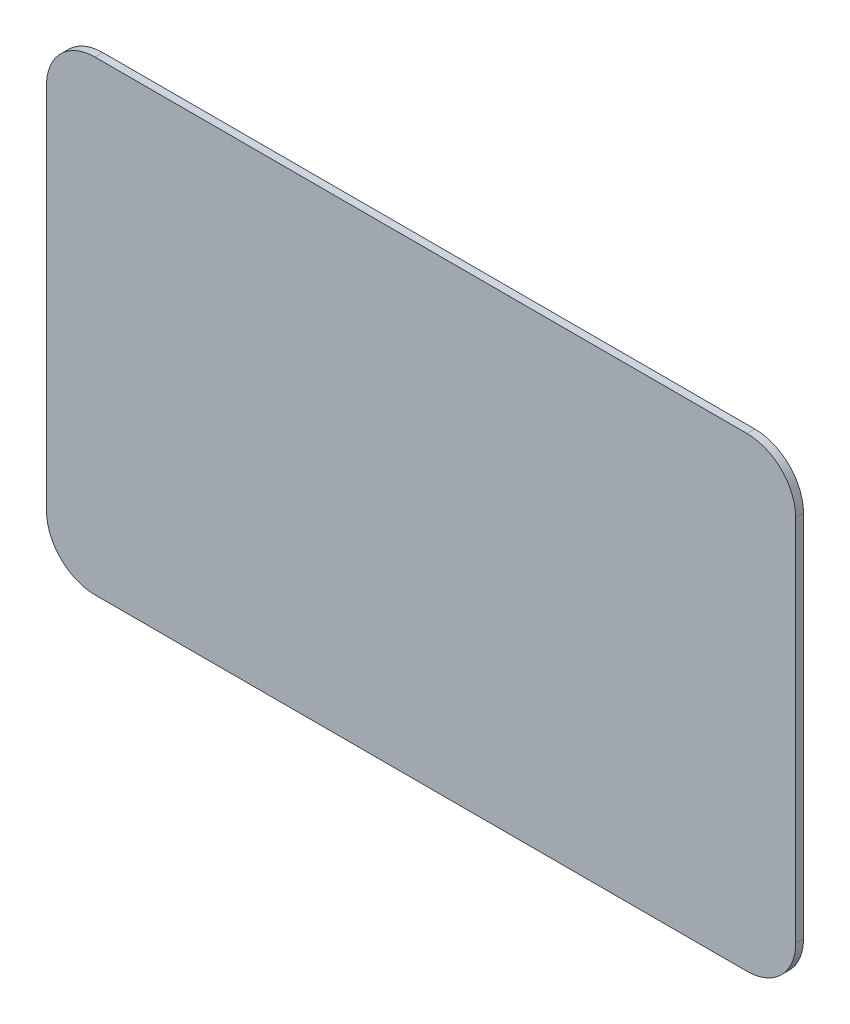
ISO-10303-21;
HEADER;
FILE_DESCRIPTION(('STEP AP214'),'2;1');
FILE_NAME('part.step','',(''),(''),'','','');
FILE_SCHEMA(('AUTOMOTIVE_DESIGN { 1 0 10303 214 1 1 1 1 }'));
ENDSEC;
DATA;
#1=APPLICATION_CONTEXT('core data for automotive mechanical design processes');
#2=APPLICATION_PROTOCOL_DEFINITION('international standard','automotive_design',2000,#1);
#3=PRODUCT_CONTEXT('',#1,'mechanical');
#4=PRODUCT('Part','Part','',(#3));
#5=PRODUCT_RELATED_PRODUCT_CATEGORY('part','',(#4));
#6=PRODUCT_DEFINITION_FORMATION('','',#4);
#7=PRODUCT_DEFINITION_CONTEXT('part definition',#1,'design');
#8=PRODUCT_DEFINITION('design','',#6,#7);
#9=PRODUCT_DEFINITION_SHAPE('','',#8);
#10=(LENGTH_UNIT() NAMED_UNIT(*) SI_UNIT(.MILLI.,.METRE.));
#11=(NAMED_UNIT(*) PLANE_ANGLE_UNIT() SI_UNIT($,.RADIAN.));
#12=(NAMED_UNIT(*) SI_UNIT($,.STERADIAN.) SOLID_ANGLE_UNIT());
#13=UNCERTAINTY_MEASURE_WITH_UNIT(LENGTH_MEASURE(1.E-05),#10,'distance_accuracy_value','');
#14=(GEOMETRIC_REPRESENTATION_CONTEXT(3) GLOBAL_UNCERTAINTY_ASSIGNED_CONTEXT((#13)) GLOBAL_UNIT_ASSIGNED_CONTEXT((#10,
#11,#12)) REPRESENTATION_CONTEXT('',''));
#15=CARTESIAN_POINT('',(0.,0.,0.));
#16=DIRECTION('',(0.,0.,1.));
#17=DIRECTION('',(1.,0.,0.));
#18=AXIS2_PLACEMENT_3D('',#15,#16,#17);
#19=CARTESIAN_POINT('',(32.4999999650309,13.,8.23));
#20=DIRECTION('',(0.,0.,-1.));
#21=DIRECTION('',(-1.,0.,0.));
#22=AXIS2_PLACEMENT_3D('',#19,#20,#21);
#23=CYLINDRICAL_SURFACE('',#22,8.5);
#24=DIRECTION('',(0.,0.,-1.));
#25=VECTOR('',#24,1.);
#26=CARTESIAN_POINT('',(40.9999999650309,13.,8.23));
#27=LINE('',#26,#25);
#28=CARTESIAN_POINT('',(40.9999999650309,13.,8.23));
#29=VERTEX_POINT('',#28);
#30=CARTESIAN_POINT('',(40.9999999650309,13.,8.2));
#31=VERTEX_POINT('',#30);
#32=EDGE_CURVE('E253',#29,#31,#27,.T.);
#33=ORIENTED_EDGE('',*,*,#32,.F.);
#34=CARTESIAN_POINT('',(32.4999999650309,13.,8.23));
#35=DIRECTION('',(0.,0.,-1.));
#36=DIRECTION('',(-1.,0.,0.));
#37=AXIS2_PLACEMENT_3D('',#34,#35,#36);
#38=CIRCLE('',#37,8.5);
#39=CARTESIAN_POINT('',(23.9999999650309,13.,8.23));
#40=VERTEX_POINT('',#39);
#41=EDGE_CURVE('E11',#40,#29,#38,.T.);
#42=ORIENTED_EDGE('',*,*,#41,.F.);
#43=DIRECTION('',(0.,0.,-1.));
#44=VECTOR('',#43,1.);
#45=CARTESIAN_POINT('',(23.9999999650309,13.,8.23));
#46=LINE('',#45,#44);
#47=CARTESIAN_POINT('',(23.9999999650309,13.,8.2));
#48=VERTEX_POINT('',#47);
#49=EDGE_CURVE('E166',#40,#48,#46,.T.);
#50=ORIENTED_EDGE('',*,*,#49,.T.);
#51=CARTESIAN_POINT('',(32.4999999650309,13.,8.2));
#52=DIRECTION('',(0.,0.,-1.));
#53=DIRECTION('',(-1.,0.,0.));
#54=AXIS2_PLACEMENT_3D('',#51,#52,#53);
#55=CIRCLE('',#54,8.5);
#56=EDGE_CURVE('E150',#48,#31,#55,.T.);
#57=ORIENTED_EDGE('',*,*,#56,.T.);
#58=EDGE_LOOP('',(#33,#42,#50,#57));
#59=FACE_BOUND('',#58,.T.);
#60=ADVANCED_FACE('F18',(#59),#23,.F.);
#61=CARTESIAN_POINT('',(32.4999999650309,13.,8.23));
#62=DIRECTION('',(0.,0.,-1.));
#63=DIRECTION('',(0.,-1.,0.));
#64=AXIS2_PLACEMENT_3D('',#61,#62,#63);
#65=PLANE('',#64);
#66=ORIENTED_EDGE('',*,*,#41,.T.);
#67=CARTESIAN_POINT('',(32.4999999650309,13.,8.23));
#68=DIRECTION('',(0.,0.,-1.));
#69=DIRECTION('',(-1.,0.,0.));
#70=AXIS2_PLACEMENT_3D('',#67,#68,#69);
#71=CIRCLE('',#70,8.5);
#72=EDGE_CURVE('E264',#29,#40,#71,.T.);
#73=ORIENTED_EDGE('',*,*,#72,.T.);
#74=EDGE_LOOP('',(#66,#73));
#75=FACE_BOUND('',#74,.T.);
#76=ADVANCED_FACE('F293',(#75),#65,.T.);
#77=CARTESIAN_POINT('',(12.4999999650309,13.0000000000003,8.23));
#78=DIRECTION('',(0.,0.,-1.));
#79=DIRECTION('',(-1.,0.,0.));
#80=AXIS2_PLACEMENT_3D('',#77,#78,#79);
#81=CYLINDRICAL_SURFACE('',#80,8.5);
#82=DIRECTION('',(0.,0.,-1.));
#83=VECTOR('',#82,1.);
#84=CARTESIAN_POINT('',(20.9999999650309,13.0000000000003,8.23));
#85=LINE('',#84,#83);
#86=CARTESIAN_POINT('',(20.9999999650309,13.0000000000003,8.23));
#87=VERTEX_POINT('',#86);
#88=CARTESIAN_POINT('',(20.9999999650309,13.0000000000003,8.2));
#89=VERTEX_POINT('',#88);
#90=EDGE_CURVE('E143',#87,#89,#85,.T.);
#91=ORIENTED_EDGE('',*,*,#90,.F.);
#92=CARTESIAN_POINT('',(12.4999999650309,13.0000000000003,8.23));
#93=DIRECTION('',(0.,0.,-1.));
#94=DIRECTION('',(-1.,0.,0.));
#95=AXIS2_PLACEMENT_3D('',#92,#93,#94);
#96=CIRCLE('',#95,8.5);
#97=CARTESIAN_POINT('',(3.99999996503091,13.0000000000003,8.23));
#98=VERTEX_POINT('',#97);
#99=EDGE_CURVE('E26',#98,#87,#96,.T.);
#100=ORIENTED_EDGE('',*,*,#99,.F.);
#101=DIRECTION('',(0.,0.,-1.));
#102=VECTOR('',#101,1.);
#103=CARTESIAN_POINT('',(3.99999996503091,13.0000000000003,8.23));
#104=LINE('',#103,#102);
#105=CARTESIAN_POINT('',(3.99999996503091,13.0000000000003,8.2));
#106=VERTEX_POINT('',#105);
#107=EDGE_CURVE('E146',#98,#106,#104,.T.);
#108=ORIENTED_EDGE('',*,*,#107,.T.);
#109=CARTESIAN_POINT('',(12.4999999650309,13.0000000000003,8.2));
#110=DIRECTION('',(0.,0.,-1.));
#111=DIRECTION('',(-1.,0.,0.));
#112=AXIS2_PLACEMENT_3D('',#109,#110,#111);
#113=CIRCLE('',#112,8.5);
#114=EDGE_CURVE('E139',#106,#89,#113,.T.);
#115=ORIENTED_EDGE('',*,*,#114,.T.);
#116=EDGE_LOOP('',(#91,#100,#108,#115));
#117=FACE_BOUND('',#116,.T.);
#118=ADVANCED_FACE('F141',(#117),#81,.F.);
#119=CARTESIAN_POINT('',(12.4999999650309,13.0000000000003,8.23));
#120=DIRECTION('',(0.,0.,-1.));
#121=DIRECTION('',(0.,-1.,0.));
#122=AXIS2_PLACEMENT_3D('',#119,#120,#121);
#123=PLANE('',#122);
#124=ORIENTED_EDGE('',*,*,#99,.T.);
#125=CARTESIAN_POINT('',(12.4999999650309,13.0000000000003,8.23));
#126=DIRECTION('',(0.,0.,-1.));
#127=DIRECTION('',(-1.,0.,0.));
#128=AXIS2_PLACEMENT_3D('',#125,#126,#127);
#129=CIRCLE('',#128,8.5);
#130=EDGE_CURVE('E159',#87,#98,#129,.T.);
#131=ORIENTED_EDGE('',*,*,#130,.T.);
#132=EDGE_LOOP('',(#124,#131));
#133=FACE_BOUND('',#132,.T.);
#134=ADVANCED_FACE('F281',(#133),#123,.T.);
#135=CARTESIAN_POINT('',(-0.500000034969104,2.4,8.2));
#136=DIRECTION('',(0.,0.,1.));
#137=DIRECTION('',(1.,0.,0.));
#138=AXIS2_PLACEMENT_3D('',#135,#136,#137);
#139=PLANE('',#138);
#140=ORIENTED_EDGE('',*,*,#114,.F.);
#141=CARTESIAN_POINT('',(12.4999999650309,13.0000000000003,8.2));
#142=DIRECTION('',(0.,0.,-1.));
#143=DIRECTION('',(-1.,0.,0.));
#144=AXIS2_PLACEMENT_3D('',#141,#142,#143);
#145=CIRCLE('',#144,8.5);
#146=EDGE_CURVE('E151',#89,#106,#145,.T.);
#147=ORIENTED_EDGE('',*,*,#146,.F.);
#148=EDGE_LOOP('',(#140,#147));
#149=FACE_BOUND('',#148,.T.);
#150=ORIENTED_EDGE('',*,*,#56,.F.);
#151=CARTESIAN_POINT('',(32.4999999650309,13.,8.2));
#152=DIRECTION('',(0.,0.,-1.));
#153=DIRECTION('',(-1.,0.,0.));
#154=AXIS2_PLACEMENT_3D('',#151,#152,#153);
#155=CIRCLE('',#154,8.5);
#156=EDGE_CURVE('E257',#31,#48,#155,.T.);
#157=ORIENTED_EDGE('',*,*,#156,.F.);
#158=EDGE_LOOP('',(#150,#157));
#159=FACE_BOUND('',#158,.T.);
#160=CARTESIAN_POINT('',(-0.500000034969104,28.4,8.2));
#161=DIRECTION('',(0.,0.,1.));
#162=DIRECTION('',(1.,0.,0.));
#163=AXIS2_PLACEMENT_3D('',#160,#161,#162);
#164=CIRCLE('',#163,3.43);
#165=CARTESIAN_POINT('',(-0.500000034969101,31.83,8.2));
#166=VERTEX_POINT('',#165);
#167=CARTESIAN_POINT('',(-3.9300000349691,28.4,8.2));
#168=VERTEX_POINT('',#167);
#169=EDGE_CURVE('E200',#166,#168,#164,.T.);
#170=ORIENTED_EDGE('',*,*,#169,.F.);
#171=DIRECTION('',(-1.,0.,0.));
#172=VECTOR('',#171,1.);
#173=CARTESIAN_POINT('',(45.4999999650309,31.83,8.2));
#174=LINE('',#173,#172);
#175=CARTESIAN_POINT('',(45.4999999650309,31.83,8.2));
#176=VERTEX_POINT('',#175);
#177=EDGE_CURVE('E211',#176,#166,#174,.T.);
#178=ORIENTED_EDGE('',*,*,#177,.F.);
#179=CARTESIAN_POINT('',(45.4999999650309,28.4,8.2));
#180=DIRECTION('',(0.,0.,1.));
#181=DIRECTION('',(1.,0.,0.));
#182=AXIS2_PLACEMENT_3D('',#179,#180,#181);
#183=CIRCLE('',#182,3.43);
#184=CARTESIAN_POINT('',(48.9299999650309,28.4,8.2));
#185=VERTEX_POINT('',#184);
#186=EDGE_CURVE('E218',#185,#176,#183,.T.);
#187=ORIENTED_EDGE('',*,*,#186,.F.);
#188=DIRECTION('',(0.,1.,0.));
#189=VECTOR('',#188,1.);
#190=CARTESIAN_POINT('',(48.9299999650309,2.4,8.2));
#191=LINE('',#190,#189);
#192=CARTESIAN_POINT('',(48.9299999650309,2.4,8.2));
#193=VERTEX_POINT('',#192);
#194=EDGE_CURVE('E230',#193,#185,#191,.T.);
#195=ORIENTED_EDGE('',*,*,#194,.F.);
#196=CARTESIAN_POINT('',(45.4999999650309,2.4,8.2));
#197=DIRECTION('',(0.,0.,1.));
#198=DIRECTION('',(1.,0.,0.));
#199=AXIS2_PLACEMENT_3D('',#196,#197,#198);
#200=CIRCLE('',#199,3.43);
#201=CARTESIAN_POINT('',(45.4999999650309,-1.03,8.2));
#202=VERTEX_POINT('',#201);
#203=EDGE_CURVE('E235',#202,#193,#200,.T.);
#204=ORIENTED_EDGE('',*,*,#203,.F.);
#205=DIRECTION('',(1.,0.,0.));
#206=VECTOR('',#205,1.);
#207=CARTESIAN_POINT('',(-0.500000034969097,-1.03,8.2));
#208=LINE('',#207,#206);
#209=CARTESIAN_POINT('',(-0.500000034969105,-1.03,8.2));
#210=VERTEX_POINT('',#209);
#211=EDGE_CURVE('E219',#210,#202,#208,.T.);
#212=ORIENTED_EDGE('',*,*,#211,.F.);
#213=CARTESIAN_POINT('',(-0.500000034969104,2.4,8.2));
#214=DIRECTION('',(0.,0.,1.));
#215=DIRECTION('',(1.,0.,0.));
#216=AXIS2_PLACEMENT_3D('',#213,#214,#215);
#217=CIRCLE('',#216,3.43);
#218=CARTESIAN_POINT('',(-3.9300000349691,2.4,8.2));
#219=VERTEX_POINT('',#218);
#220=EDGE_CURVE('E49',#219,#210,#217,.T.);
#221=ORIENTED_EDGE('',*,*,#220,.F.);
#222=DIRECTION('',(0.,-1.,0.));
#223=VECTOR('',#222,1.);
#224=CARTESIAN_POINT('',(-3.9300000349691,28.4,8.2));
#225=LINE('',#224,#223);
#226=EDGE_CURVE('E39',#168,#219,#225,.T.);
#227=ORIENTED_EDGE('',*,*,#226,.F.);
#228=EDGE_LOOP('',(#170,#178,#187,#195,#204,#212,#221,#227));
#229=FACE_BOUND('',#228,.T.);
#230=ADVANCED_FACE('F152',(#149,#159,#229),#139,.F.);
#231=CARTESIAN_POINT('',(-3.9300000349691,28.4,8.2));
#232=DIRECTION('',(-1.,0.,0.));
#233=DIRECTION('',(0.,0.,1.));
#234=AXIS2_PLACEMENT_3D('',#231,#232,#233);
#235=PLANE('',#234);
#236=ORIENTED_EDGE('',*,*,#226,.T.);
#237=DIRECTION('',(0.,0.,-1.));
#238=VECTOR('',#237,1.);
#239=CARTESIAN_POINT('',(-3.93000003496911,2.4,8.2));
#240=LINE('',#239,#238);
#241=CARTESIAN_POINT('',(-3.9300000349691,2.4,8.75));
#242=VERTEX_POINT('',#241);
#243=EDGE_CURVE('E178',#242,#219,#240,.T.);
#244=ORIENTED_EDGE('',*,*,#243,.F.);
#245=DIRECTION('',(0.,-1.,0.));
#246=VECTOR('',#245,1.);
#247=CARTESIAN_POINT('',(-3.9300000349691,2.4,8.75));
#248=LINE('',#247,#246);
#249=CARTESIAN_POINT('',(-3.9300000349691,28.4,8.75));
#250=VERTEX_POINT('',#249);
#251=EDGE_CURVE('E186',#250,#242,#248,.T.);
#252=ORIENTED_EDGE('',*,*,#251,.F.);
#253=DIRECTION('',(0.,0.,1.));
#254=VECTOR('',#253,1.);
#255=CARTESIAN_POINT('',(-3.93000003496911,28.4,8.2));
#256=LINE('',#255,#254);
#257=EDGE_CURVE('E204',#168,#250,#256,.T.);
#258=ORIENTED_EDGE('',*,*,#257,.F.);
#259=EDGE_LOOP('',(#236,#244,#252,#258));
#260=FACE_BOUND('',#259,.T.);
#261=ADVANCED_FACE('F291',(#260),#235,.T.);
#262=CARTESIAN_POINT('',(-0.500000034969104,2.4,8.2));
#263=DIRECTION('',(0.,0.,1.));
#264=DIRECTION('',(1.,0.,0.));
#265=AXIS2_PLACEMENT_3D('',#262,#263,#264);
#266=CYLINDRICAL_SURFACE('',#265,3.43);
#267=ORIENTED_EDGE('',*,*,#220,.T.);
#268=DIRECTION('',(0.,0.,-1.));
#269=VECTOR('',#268,1.);
#270=CARTESIAN_POINT('',(-0.500000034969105,-1.03,8.2));
#271=LINE('',#270,#269);
#272=CARTESIAN_POINT('',(-0.500000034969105,-1.02999999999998,8.75));
#273=VERTEX_POINT('',#272);
#274=EDGE_CURVE('E222',#273,#210,#271,.T.);
#275=ORIENTED_EDGE('',*,*,#274,.F.);
#276=CARTESIAN_POINT('',(-0.500000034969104,2.4,8.75));
#277=DIRECTION('',(0.,0.,1.));
#278=DIRECTION('',(1.,0.,0.));
#279=AXIS2_PLACEMENT_3D('',#276,#277,#278);
#280=CIRCLE('',#279,3.43);
#281=EDGE_CURVE('E181',#242,#273,#280,.T.);
#282=ORIENTED_EDGE('',*,*,#281,.F.);
#283=ORIENTED_EDGE('',*,*,#243,.T.);
#284=EDGE_LOOP('',(#267,#275,#282,#283));
#285=FACE_BOUND('',#284,.T.);
#286=ADVANCED_FACE('F308',(#285),#266,.T.);
#287=CARTESIAN_POINT('',(-0.500000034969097,-1.03,8.2));
#288=DIRECTION('',(0.,-1.,0.));
#289=DIRECTION('',(0.,0.,-1.));
#290=AXIS2_PLACEMENT_3D('',#287,#288,#289);
#291=PLANE('',#290);
#292=ORIENTED_EDGE('',*,*,#211,.T.);
#293=DIRECTION('',(0.,0.,-1.));
#294=VECTOR('',#293,1.);
#295=CARTESIAN_POINT('',(45.4999999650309,-1.03,8.2));
#296=LINE('',#295,#294);
#297=CARTESIAN_POINT('',(45.4999999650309,-1.02999999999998,8.75));
#298=VERTEX_POINT('',#297);
#299=EDGE_CURVE('E223',#298,#202,#296,.T.);
#300=ORIENTED_EDGE('',*,*,#299,.F.);
#301=DIRECTION('',(1.,0.,0.));
#302=VECTOR('',#301,1.);
#303=CARTESIAN_POINT('',(-0.500000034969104,-1.02999999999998,8.75));
#304=LINE('',#303,#302);
#305=EDGE_CURVE('E185',#273,#298,#304,.T.);
#306=ORIENTED_EDGE('',*,*,#305,.F.);
#307=ORIENTED_EDGE('',*,*,#274,.T.);
#308=EDGE_LOOP('',(#292,#300,#306,#307));
#309=FACE_BOUND('',#308,.T.);
#310=ADVANCED_FACE('F306',(#309),#291,.T.);
#311=CARTESIAN_POINT('',(45.4999999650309,2.4,8.2));
#312=DIRECTION('',(0.,0.,1.));
#313=DIRECTION('',(1.,0.,0.));
#314=AXIS2_PLACEMENT_3D('',#311,#312,#313);
#315=CYLINDRICAL_SURFACE('',#314,3.43);
#316=ORIENTED_EDGE('',*,*,#203,.T.);
#317=DIRECTION('',(0.,0.,-1.));
#318=VECTOR('',#317,1.);
#319=CARTESIAN_POINT('',(48.9299999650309,2.4,8.2));
#320=LINE('',#319,#318);
#321=CARTESIAN_POINT('',(48.9299999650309,2.4,8.75));
#322=VERTEX_POINT('',#321);
#323=EDGE_CURVE('E170',#322,#193,#320,.T.);
#324=ORIENTED_EDGE('',*,*,#323,.F.);
#325=CARTESIAN_POINT('',(45.4999999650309,2.4,8.75));
#326=DIRECTION('',(0.,0.,1.));
#327=DIRECTION('',(1.,0.,0.));
#328=AXIS2_PLACEMENT_3D('',#325,#326,#327);
#329=CIRCLE('',#328,3.43);
#330=EDGE_CURVE('E177',#298,#322,#329,.T.);
#331=ORIENTED_EDGE('',*,*,#330,.F.);
#332=ORIENTED_EDGE('',*,*,#299,.T.);
#333=EDGE_LOOP('',(#316,#324,#331,#332));
#334=FACE_BOUND('',#333,.T.);
#335=ADVANCED_FACE('F315',(#334),#315,.T.);
#336=CARTESIAN_POINT('',(48.9299999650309,2.4,8.2));
#337=DIRECTION('',(1.,0.,0.));
#338=DIRECTION('',(0.,1.,0.));
#339=AXIS2_PLACEMENT_3D('',#336,#337,#338);
#340=PLANE('',#339);
#341=ORIENTED_EDGE('',*,*,#194,.T.);
#342=DIRECTION('',(0.,0.,-1.));
#343=VECTOR('',#342,1.);
#344=CARTESIAN_POINT('',(48.9299999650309,28.4,8.2));
#345=LINE('',#344,#343);
#346=CARTESIAN_POINT('',(48.9299999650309,28.4,8.75));
#347=VERTEX_POINT('',#346);
#348=EDGE_CURVE('E226',#347,#185,#345,.T.);
#349=ORIENTED_EDGE('',*,*,#348,.F.);
#350=DIRECTION('',(0.,1.,0.));
#351=VECTOR('',#350,1.);
#352=CARTESIAN_POINT('',(48.9299999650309,2.4,8.75));
#353=LINE('',#352,#351);
#354=EDGE_CURVE('E172',#322,#347,#353,.T.);
#355=ORIENTED_EDGE('',*,*,#354,.F.);
#356=ORIENTED_EDGE('',*,*,#323,.T.);
#357=EDGE_LOOP('',(#341,#349,#355,#356));
#358=FACE_BOUND('',#357,.T.);
#359=ADVANCED_FACE('F325',(#358),#340,.T.);
#360=CARTESIAN_POINT('',(45.4999999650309,28.4,8.2));
#361=DIRECTION('',(0.,0.,1.));
#362=DIRECTION('',(1.,0.,0.));
#363=AXIS2_PLACEMENT_3D('',#360,#361,#362);
#364=CYLINDRICAL_SURFACE('',#363,3.43);
#365=ORIENTED_EDGE('',*,*,#186,.T.);
#366=DIRECTION('',(0.,0.,-1.));
#367=VECTOR('',#366,1.);
#368=CARTESIAN_POINT('',(45.4999999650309,31.83,8.2));
#369=LINE('',#368,#367);
#370=CARTESIAN_POINT('',(45.4999999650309,31.83,8.75));
#371=VERTEX_POINT('',#370);
#372=EDGE_CURVE('E214',#371,#176,#369,.T.);
#373=ORIENTED_EDGE('',*,*,#372,.F.);
#374=CARTESIAN_POINT('',(45.4999999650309,28.4,8.75));
#375=DIRECTION('',(0.,0.,1.));
#376=DIRECTION('',(1.,0.,0.));
#377=AXIS2_PLACEMENT_3D('',#374,#375,#376);
#378=CIRCLE('',#377,3.43);
#379=EDGE_CURVE('E176',#347,#371,#378,.T.);
#380=ORIENTED_EDGE('',*,*,#379,.F.);
#381=ORIENTED_EDGE('',*,*,#348,.T.);
#382=EDGE_LOOP('',(#365,#373,#380,#381));
#383=FACE_BOUND('',#382,.T.);
#384=ADVANCED_FACE('F322',(#383),#364,.T.);
#385=CARTESIAN_POINT('',(45.4999999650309,31.83,8.2));
#386=DIRECTION('',(0.,1.,0.));
#387=DIRECTION('',(1.,0.,0.));
#388=AXIS2_PLACEMENT_3D('',#385,#386,#387);
#389=PLANE('',#388);
#390=ORIENTED_EDGE('',*,*,#177,.T.);
#391=DIRECTION('',(0.,0.,-1.));
#392=VECTOR('',#391,1.);
#393=CARTESIAN_POINT('',(-0.500000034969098,31.83,8.2));
#394=LINE('',#393,#392);
#395=CARTESIAN_POINT('',(-0.500000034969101,31.83,8.75));
#396=VERTEX_POINT('',#395);
#397=EDGE_CURVE('E207',#396,#166,#394,.T.);
#398=ORIENTED_EDGE('',*,*,#397,.F.);
#399=DIRECTION('',(-1.,0.,0.));
#400=VECTOR('',#399,1.);
#401=CARTESIAN_POINT('',(-0.500000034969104,31.83,8.75));
#402=LINE('',#401,#400);
#403=EDGE_CURVE('E189',#371,#396,#402,.T.);
#404=ORIENTED_EDGE('',*,*,#403,.F.);
#405=ORIENTED_EDGE('',*,*,#372,.T.);
#406=EDGE_LOOP('',(#390,#398,#404,#405));
#407=FACE_BOUND('',#406,.T.);
#408=ADVANCED_FACE('F348',(#407),#389,.T.);
#409=CARTESIAN_POINT('',(-0.500000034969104,28.4,8.2));
#410=DIRECTION('',(0.,0.,1.));
#411=DIRECTION('',(1.,0.,0.));
#412=AXIS2_PLACEMENT_3D('',#409,#410,#411);
#413=CYLINDRICAL_SURFACE('',#412,3.43);
#414=ORIENTED_EDGE('',*,*,#169,.T.);
#415=ORIENTED_EDGE('',*,*,#257,.T.);
#416=CARTESIAN_POINT('',(-0.500000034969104,28.4,8.75));
#417=DIRECTION('',(0.,0.,1.));
#418=DIRECTION('',(1.,0.,0.));
#419=AXIS2_PLACEMENT_3D('',#416,#417,#418);
#420=CIRCLE('',#419,3.43);
#421=EDGE_CURVE('E193',#396,#250,#420,.T.);
#422=ORIENTED_EDGE('',*,*,#421,.F.);
#423=ORIENTED_EDGE('',*,*,#397,.T.);
#424=EDGE_LOOP('',(#414,#415,#422,#423));
#425=FACE_BOUND('',#424,.T.);
#426=ADVANCED_FACE('F506',(#425),#413,.T.);
#427=CARTESIAN_POINT('',(-0.500000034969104,2.4,8.75));
#428=DIRECTION('',(0.,0.,1.));
#429=DIRECTION('',(1.,0.,0.));
#430=AXIS2_PLACEMENT_3D('',#427,#428,#429);
#431=PLANE('',#430);
#432=ORIENTED_EDGE('',*,*,#403,.T.);
#433=ORIENTED_EDGE('',*,*,#421,.T.);
#434=ORIENTED_EDGE('',*,*,#251,.T.);
#435=ORIENTED_EDGE('',*,*,#281,.T.);
#436=ORIENTED_EDGE('',*,*,#305,.T.);
#437=ORIENTED_EDGE('',*,*,#330,.T.);
#438=ORIENTED_EDGE('',*,*,#354,.T.);
#439=ORIENTED_EDGE('',*,*,#379,.T.);
#440=EDGE_LOOP('',(#432,#433,#434,#435,#436,#437,#438,#439));
#441=FACE_BOUND('',#440,.T.);
#442=ADVANCED_FACE('F352',(#441),#431,.T.);
#443=CARTESIAN_POINT('',(12.4999999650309,13.0000000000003,8.23));
#444=DIRECTION('',(0.,0.,-1.));
#445=DIRECTION('',(-1.,0.,0.));
#446=AXIS2_PLACEMENT_3D('',#443,#444,#445);
#447=CYLINDRICAL_SURFACE('',#446,8.5);
#448=ORIENTED_EDGE('',*,*,#130,.F.);
#449=ORIENTED_EDGE('',*,*,#90,.T.);
#450=ORIENTED_EDGE('',*,*,#146,.T.);
#451=ORIENTED_EDGE('',*,*,#107,.F.);
#452=EDGE_LOOP('',(#448,#449,#450,#451));
#453=FACE_BOUND('',#452,.T.);
#454=ADVANCED_FACE('F157',(#453),#447,.F.);
#455=CARTESIAN_POINT('',(32.4999999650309,13.,8.23));
#456=DIRECTION('',(0.,0.,-1.));
#457=DIRECTION('',(-1.,0.,0.));
#458=AXIS2_PLACEMENT_3D('',#455,#456,#457);
#459=CYLINDRICAL_SURFACE('',#458,8.5);
#460=ORIENTED_EDGE('',*,*,#72,.F.);
#461=ORIENTED_EDGE('',*,*,#32,.T.);
#462=ORIENTED_EDGE('',*,*,#156,.T.);
#463=ORIENTED_EDGE('',*,*,#49,.F.);
#464=EDGE_LOOP('',(#460,#461,#462,#463));
#465=FACE_BOUND('',#464,.T.);
#466=ADVANCED_FACE('F262',(#465),#459,.F.);
#467=CLOSED_SHELL('',(#60,#76,#118,#134,#230,#261,#286,#310,#335,#359,#384,#408,#426,#442,#454,#466));
#468=MANIFOLD_SOLID_BREP('B1',#467);
#469=ADVANCED_BREP_SHAPE_REPRESENTATION('',(#18,#468),#14);
#470=SHAPE_DEFINITION_REPRESENTATION(#9,#469);
ENDSEC;
END-ISO-10303-21;
